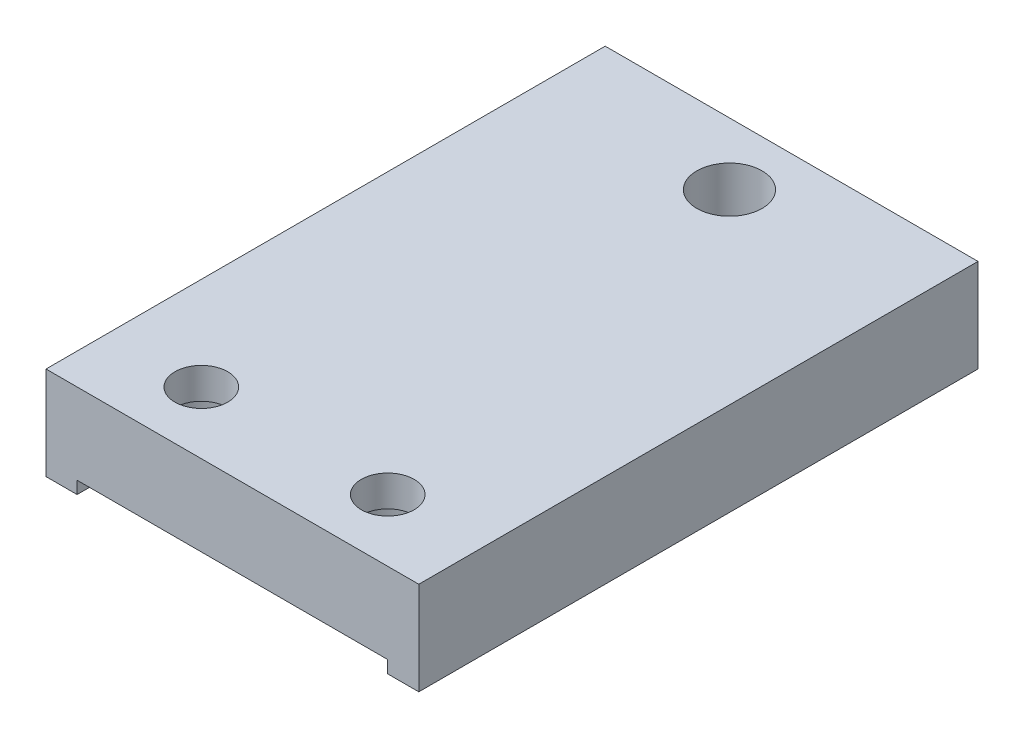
from build123d import *

# Parameters (mm, degrees)
ESQUISSE1_W                             = 60
ESQUISSE1_H                             = 15
EXTRUSION1_DEPTH                        = 90
ESQUISSE2_W                             = 50
ESQUISSE2_H                             = 2
ENL_V_MAT_EXTRU_1_DEPTH                 = 110.201648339
CHAMBRAGE_POUR_AXES_8_5_MM1_D           = 8.5
CHAMBRAGE_POUR_AXES_8_5_MM1_CBORE_D     = 15
CHAMBRAGE_POUR_AXES_8_5_MM1_CBORE_DEPTH = 8
DIAM_TRE_DU_PER_AGE_10_5_10_5_1_D       = 10.5


with BuildPart() as part:
    # Esquisse1 → Extrusion1 (new body)
    with BuildSketch(Plane.XY):
        with Locations((30, 7.5)):
            Rectangle(ESQUISSE1_W, ESQUISSE1_H)
    extrude(amount=EXTRUSION1_DEPTH)

    # Esquisse2 → Enl_v. mat.-Extru.1 (cut, through all)
    with BuildSketch(Plane.XY.offset(90)):
        with Locations((30, 1)):
            Rectangle(ESQUISSE2_W, ESQUISSE2_H)
    extrude(amount=-ENL_V_MAT_EXTRU_1_DEPTH, mode=Mode.SUBTRACT)

    # Chambrage pour axes 8.5 mm1 (through all)
    with Locations(Plane(origin=(-40.1288657, 2, 38.387054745), x_dir=(-1, 0, 0), z_dir=(0, -1, 0))):
        with Locations((-55.1288657, -41.612945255), (-85.1288657, -41.612945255)):
            CounterBoreHole(CHAMBRAGE_POUR_AXES_8_5_MM1_D / 2, CHAMBRAGE_POUR_AXES_8_5_MM1_CBORE_D / 2, CHAMBRAGE_POUR_AXES_8_5_MM1_CBORE_DEPTH)

    # Diam_tre du per_age _10.5 _10_5 _1 (through all)
    with Locations(Plane(origin=(0, 15, 0), x_dir=(-1, 0, 0), z_dir=(0, 1, 0))):
        with Locations((-30, 10)):
            Hole(DIAM_TRE_DU_PER_AGE_10_5_10_5_1_D / 2)


solid = part.part
